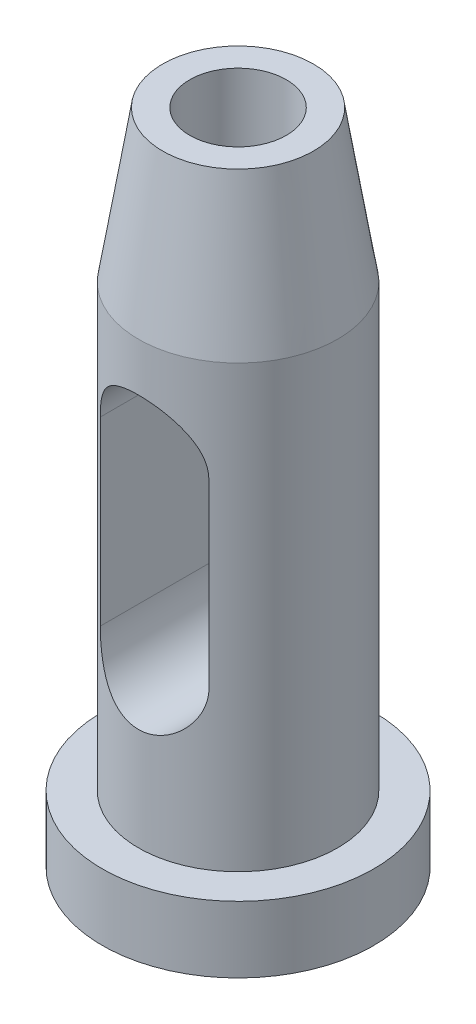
from build123d import *

# Parameters (mm, degrees)
CUT_EXTRUDE1_DEPTH                   = 114.549548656
CUT_EXTRUDE1_DEPTH_BACK              = 114.549548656
M16_0_16_000000_DIAMETER_HOLE1_D     = 16
M16_0_16_000000_DIAMETER_HOLE1_DEPTH = 42
M16_0_16_000000_DIAMETER_HOLE1_TIP   = 4.806884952


with BuildPart() as part:
    # Sketch4 → Revolve1 (revolve)
    with BuildSketch(Plane.XY, mode=Mode.PRIVATE) as revolve1_sk:
        Polygon((0, 0), (22.5, 0), (22.5, 11), (16.5, 11), (16.5, 84), (12.5, 109), (0, 109), align=None)
    revolve(revolve1_sk.sketch.rotate(Axis((0, 0, 0), (0, 1, 0)), 90), axis=Axis((0, 0, 0), (0, 1, 0)))

    # Sketch5 → Cut-Extrude1 (cut, two sides: drawn at the far end of the back side and taken through both)
    with BuildSketch(Plane.XY.offset(-CUT_EXTRUDE1_DEPTH_BACK)):
        with BuildLine():
            Line((9, 37), (9, 67))
            ThreePointArc((9, 67), (0, 76), (-9, 67))
            Line((-9, 67), (-9, 37))
            ThreePointArc((-9, 37), (0, 28), (9, 37))
        make_face()
    extrude(amount=CUT_EXTRUDE1_DEPTH + CUT_EXTRUDE1_DEPTH_BACK, mode=Mode.SUBTRACT)

    # M16.0 _16.000000_ Diameter Hole1
    with Locations(Plane(origin=(0, 109, 0), x_dir=(-1, 0, 0), z_dir=(0, 1, 0))):
        with Locations((0, 0)):
            Hole(M16_0_16_000000_DIAMETER_HOLE1_D / 2, depth=M16_0_16_000000_DIAMETER_HOLE1_DEPTH)
            with Locations((0, 0, -(M16_0_16_000000_DIAMETER_HOLE1_DEPTH + M16_0_16_000000_DIAMETER_HOLE1_TIP / 2))):  # 118° drill point
                Cone(0, M16_0_16_000000_DIAMETER_HOLE1_D / 2, M16_0_16_000000_DIAMETER_HOLE1_TIP, mode=Mode.SUBTRACT)


solid = part.part
